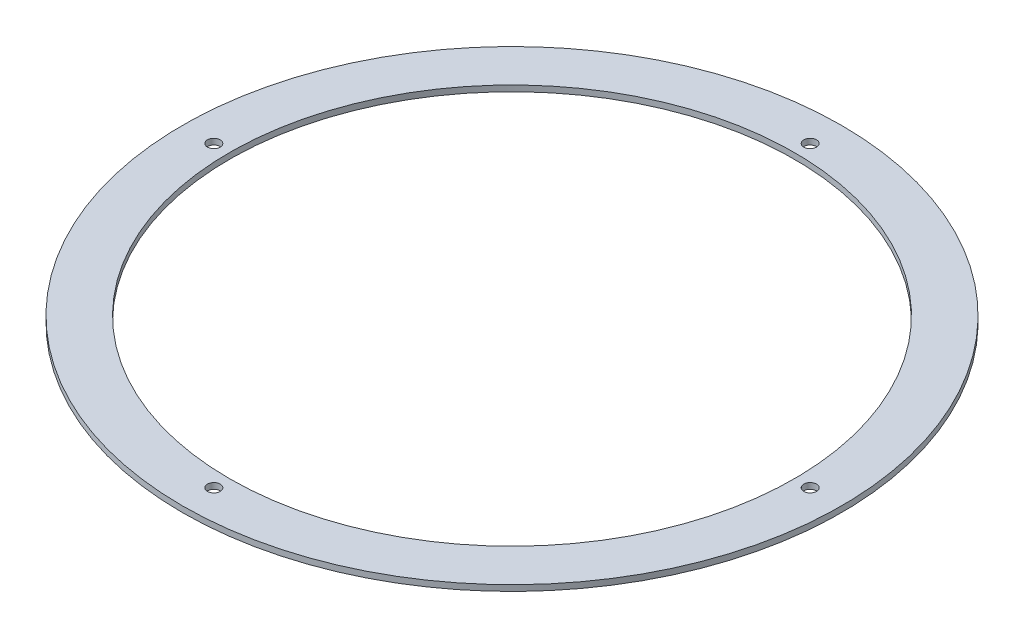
from build123d import *

# Parameters (mm, degrees)
SKETCH1_R          = 533.4
SKETCH1_R_2        = 457.2
EXTRUDE1_DEPTH     = 9.525
SKETCH2_R          = 10.3124
CUT_EXTRUDE1_DEPTH = 755.401647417
CIRPATTERN1_COUNT  = 4


with BuildPart() as part:
    # Sketch1 → Extrude1 (new body)
    with BuildSketch(Plane(origin=(0, 0, 0), x_dir=(1, 0, 0), z_dir=(0, 1, 0))):
        with Locations(Location((0, 0, 0), (0, 0, 270))):
            Circle(SKETCH1_R)
        with Locations(Location((0, 0, 0), (0, 0, 270))):
            Circle(SKETCH1_R_2, mode=Mode.SUBTRACT)
    extrude(amount=-EXTRUDE1_DEPTH)

    # Sketch2 → Cut-Extrude1 (cut, through all)
    with BuildSketch(Plane(origin=(0, 0, 0), x_dir=(-1, 0, 0), z_dir=(0, 1, 0))):
        with Locations(Location((0, -482.6, 0), (0, 0, 90))):
            Circle(SKETCH2_R)
    cut_extrude1 = extrude(amount=-CUT_EXTRUDE1_DEPTH, mode=Mode.SUBTRACT)

    # CirPattern1: Cut-Extrude1 ×4 about axis
    cirpattern1_axis = Axis((0, 0, 0), (0, 1, 0))
    for i in range(1, CIRPATTERN1_COUNT):
        add(cut_extrude1.rotate(cirpattern1_axis, i * 360 / CIRPATTERN1_COUNT), mode=Mode.SUBTRACT)


solid = part.part
